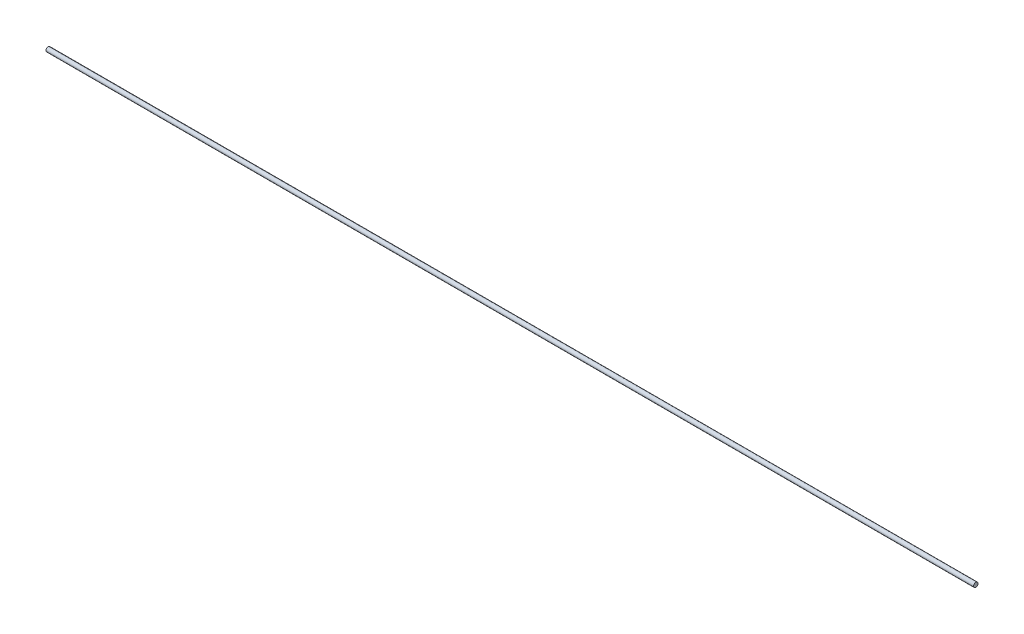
ISO-10303-21;
HEADER;
FILE_DESCRIPTION(('STEP AP214'),'2;1');
FILE_NAME('part.step','',(''),(''),'','','');
FILE_SCHEMA(('AUTOMOTIVE_DESIGN { 1 0 10303 214 1 1 1 1 }'));
ENDSEC;
DATA;
#1=APPLICATION_CONTEXT('core data for automotive mechanical design processes');
#2=APPLICATION_PROTOCOL_DEFINITION('international standard','automotive_design',2000,#1);
#3=PRODUCT_CONTEXT('',#1,'mechanical');
#4=PRODUCT('Part','Part','',(#3));
#5=PRODUCT_RELATED_PRODUCT_CATEGORY('part','',(#4));
#6=PRODUCT_DEFINITION_FORMATION('','',#4);
#7=PRODUCT_DEFINITION_CONTEXT('part definition',#1,'design');
#8=PRODUCT_DEFINITION('design','',#6,#7);
#9=PRODUCT_DEFINITION_SHAPE('','',#8);
#10=(LENGTH_UNIT() NAMED_UNIT(*) SI_UNIT(.MILLI.,.METRE.));
#11=(NAMED_UNIT(*) PLANE_ANGLE_UNIT() SI_UNIT($,.RADIAN.));
#12=(NAMED_UNIT(*) SI_UNIT($,.STERADIAN.) SOLID_ANGLE_UNIT());
#13=UNCERTAINTY_MEASURE_WITH_UNIT(LENGTH_MEASURE(1.E-05),#10,'distance_accuracy_value','');
#14=(GEOMETRIC_REPRESENTATION_CONTEXT(3) GLOBAL_UNCERTAINTY_ASSIGNED_CONTEXT((#13)) GLOBAL_UNIT_ASSIGNED_CONTEXT((#10,
#11,#12)) REPRESENTATION_CONTEXT('',''));
#15=CARTESIAN_POINT('',(0.,0.,0.));
#16=DIRECTION('',(0.,0.,1.));
#17=DIRECTION('',(1.,0.,0.));
#18=AXIS2_PLACEMENT_3D('',#15,#16,#17);
#19=CARTESIAN_POINT('',(2996.55,0.,0.));
#20=DIRECTION('',(-1.,0.,0.));
#21=DIRECTION('',(0.,0.,1.));
#22=AXIS2_PLACEMENT_3D('',#19,#20,#21);
#23=CYLINDRICAL_SURFACE('',#22,14.3256);
#24=CARTESIAN_POINT('',(2996.55,0.,0.));
#25=DIRECTION('',(1.,0.,0.));
#26=DIRECTION('',(0.,0.,-1.));
#27=AXIS2_PLACEMENT_3D('',#24,#25,#26);
#28=CIRCLE('',#27,14.3256);
#29=CARTESIAN_POINT('',(2996.55,0.,-14.3256));
#30=VERTEX_POINT('',#29);
#31=EDGE_CURVE('E10',#30,#30,#28,.T.);
#32=ORIENTED_EDGE('',*,*,#31,.F.);
#33=EDGE_LOOP('',(#32));
#34=FACE_BOUND('',#33,.T.);
#35=CARTESIAN_POINT('',(-2996.55,0.,0.));
#36=DIRECTION('',(1.,0.,0.));
#37=DIRECTION('',(0.,0.,-1.));
#38=AXIS2_PLACEMENT_3D('',#35,#36,#37);
#39=CIRCLE('',#38,14.3256);
#40=CARTESIAN_POINT('',(-2996.55,0.,-14.3256));
#41=VERTEX_POINT('',#40);
#42=EDGE_CURVE('E45',#41,#41,#39,.T.);
#43=ORIENTED_EDGE('',*,*,#42,.T.);
#44=EDGE_LOOP('',(#43));
#45=FACE_BOUND('',#44,.T.);
#46=ADVANCED_FACE('F39',(#34,#45),#23,.T.);
#47=CARTESIAN_POINT('',(2996.55,0.,0.));
#48=DIRECTION('',(1.,0.,0.));
#49=DIRECTION('',(0.,0.,-1.));
#50=AXIS2_PLACEMENT_3D('',#47,#48,#49);
#51=PLANE('',#50);
#52=ORIENTED_EDGE('',*,*,#31,.T.);
#53=EDGE_LOOP('',(#52));
#54=FACE_BOUND('',#53,.T.);
#55=ADVANCED_FACE('F53',(#54),#51,.T.);
#56=CARTESIAN_POINT('',(-2996.55,0.,0.));
#57=DIRECTION('',(1.,0.,0.));
#58=DIRECTION('',(0.,0.,-1.));
#59=AXIS2_PLACEMENT_3D('',#56,#57,#58);
#60=PLANE('',#59);
#61=ORIENTED_EDGE('',*,*,#42,.F.);
#62=EDGE_LOOP('',(#61));
#63=FACE_BOUND('',#62,.T.);
#64=ADVANCED_FACE('F55',(#63),#60,.F.);
#65=CLOSED_SHELL('',(#46,#55,#64));
#66=MANIFOLD_SOLID_BREP('B2',#65);
#67=ADVANCED_BREP_SHAPE_REPRESENTATION('',(#18,#66),#14);
#68=SHAPE_DEFINITION_REPRESENTATION(#9,#67);
ENDSEC;
END-ISO-10303-21;
